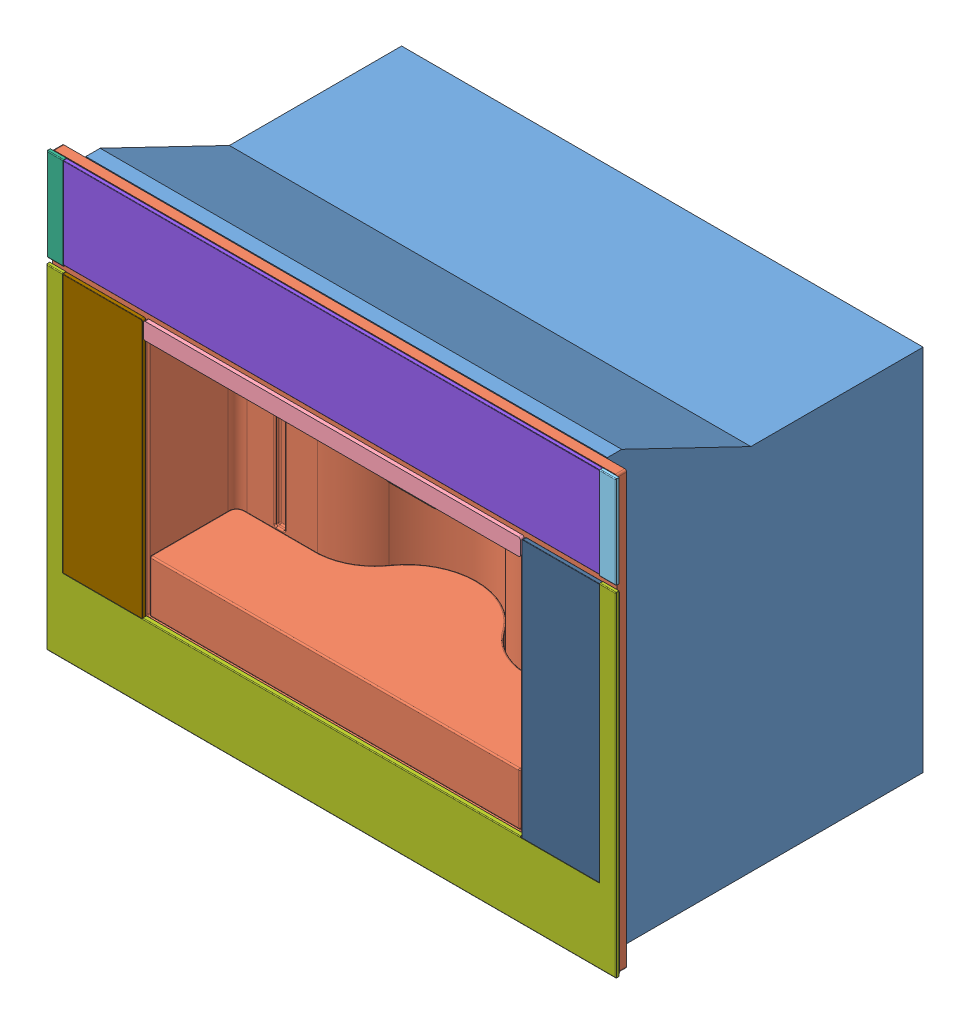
SolidWorks assembly 465211_CMA9200UX.SLDASM, configuration Default (file format 5000). Lengths in mm.
Overall size (595.06 451.91 345.99).
11 component instances, 11 part files, 0 mates.
Components (placement in the parent):
- PART24-1: PART24.sldprt [Default] at (0 0 -10) x (-1 0 0) z (0 0 -1) size (545 450 330)
- ESPRESSO MACHINE-1: ESPRESSO MACHINE.sldprt [Default] at (-0.8451 -1.9466 1.4865) size (590 451.5 303)
- PART23-1: PART23.sldprt [Default] at (0 333.0534 0) x (1 0 0) z (0 -1 0) size (70 50 86)
- PARTBODY-3-1: PARTBODY-3.sldprt [Default] at (295.1268 498.1809 -259.6416) x (1 0 0) z (0 0 1) size (394 17.5 4)
- I nalimek cp_x_t-1: I nalimek cp_x_t.sldprt [Default] at (583.4967 405.6127 5.9865) x (0.000004 1 0) z (0 0 -1) size (96.5 17 3.5)
- MirrorI nalimek cp_x_t-1: MirrorI nalimek cp_x_t.sldprt [Default] at (6.7568 405.6127 5.9865) x (-0.000004 1 0) z (0 0 1) size (96.5 17 3.5)
- Nalepek kavnega avtomata G-1: Nalepek kavnega avtomata G.sldprt [Default] at (294.8345 176.0629 5.4865) x (1 0.000004 0) z (0 0 1) size (595 349 4.46)
- PARTBODY-2-1: PARTBODY-2.sldprt [Default] at (295.1268 498.1809 -259.6416) x (1 0 0) z (0 0 1) size (594.1 96.1 4)
- BODY.2-11-1: BODY.2-11.sldprt [Default] at (295.1268 498.1809 -259.6416) x (1 0 0) z (0 0 1) size (99.39 347.89 4)
- BODY.2-12-1: BODY.2-12.sldprt [Default] at (295.1268 498.1809 -259.6416) x (1 0 0) z (0 0 1) size (99.39 347.89 4)
- BODY.2-13-1: BODY.2-13.sldprt [Default] at (295.1268 498.1809 -259.6416) x (1 0 0) z (0 0 1) size (394.39 77.39 4)
